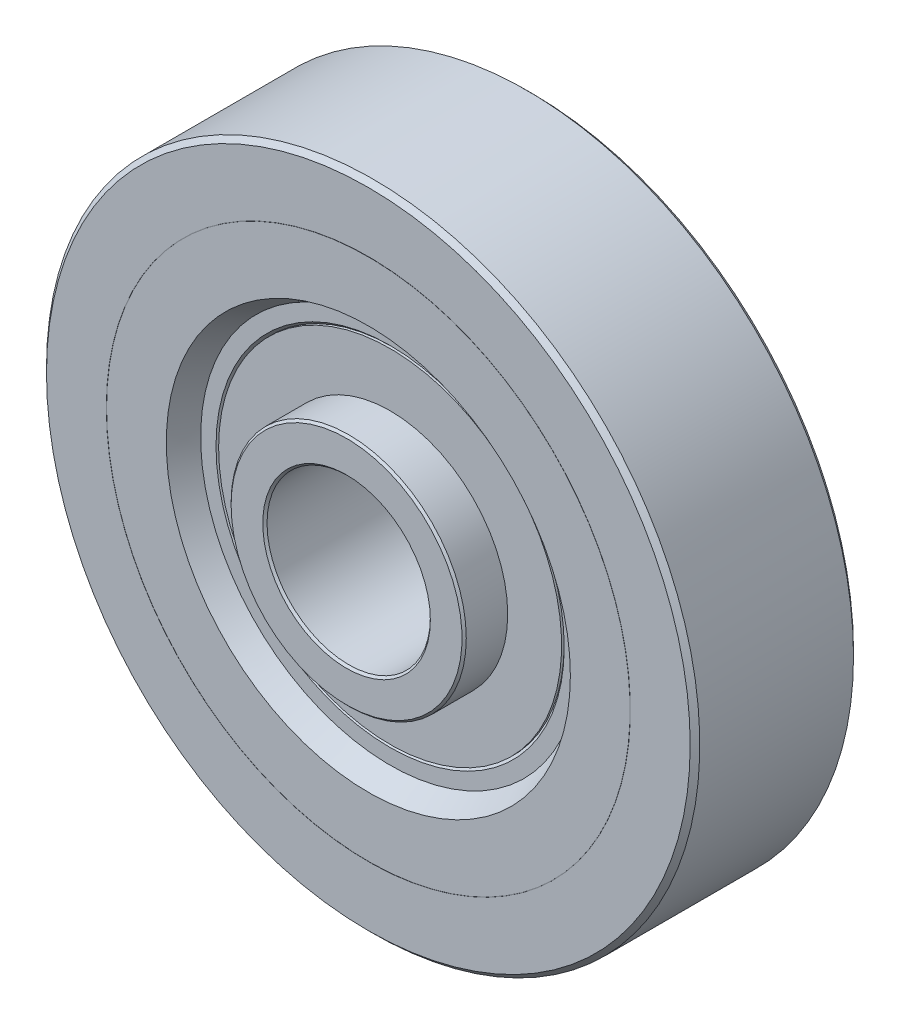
ISO-10303-21;
HEADER;
FILE_DESCRIPTION(('STEP AP214'),'2;1');
FILE_NAME('part.step','',(''),(''),'','','');
FILE_SCHEMA(('AUTOMOTIVE_DESIGN { 1 0 10303 214 1 1 1 1 }'));
ENDSEC;
DATA;
#1=APPLICATION_CONTEXT('core data for automotive mechanical design processes');
#2=APPLICATION_PROTOCOL_DEFINITION('international standard','automotive_design',2000,#1);
#3=PRODUCT_CONTEXT('',#1,'mechanical');
#4=PRODUCT('Part','Part','',(#3));
#5=PRODUCT_RELATED_PRODUCT_CATEGORY('part','',(#4));
#6=PRODUCT_DEFINITION_FORMATION('','',#4);
#7=PRODUCT_DEFINITION_CONTEXT('part definition',#1,'design');
#8=PRODUCT_DEFINITION('design','',#6,#7);
#9=PRODUCT_DEFINITION_SHAPE('','',#8);
#10=(LENGTH_UNIT() NAMED_UNIT(*) SI_UNIT(.MILLI.,.METRE.));
#11=(NAMED_UNIT(*) PLANE_ANGLE_UNIT() SI_UNIT($,.RADIAN.));
#12=(NAMED_UNIT(*) SI_UNIT($,.STERADIAN.) SOLID_ANGLE_UNIT());
#13=UNCERTAINTY_MEASURE_WITH_UNIT(LENGTH_MEASURE(1.E-05),#10,'distance_accuracy_value','');
#14=(GEOMETRIC_REPRESENTATION_CONTEXT(3) GLOBAL_UNCERTAINTY_ASSIGNED_CONTEXT((#13)) GLOBAL_UNIT_ASSIGNED_CONTEXT((#10,
#11,#12)) REPRESENTATION_CONTEXT('',''));
#15=CARTESIAN_POINT('',(0.,0.,0.));
#16=DIRECTION('',(0.,0.,1.));
#17=DIRECTION('',(1.,0.,0.));
#18=AXIS2_PLACEMENT_3D('',#15,#16,#17);
#19=CARTESIAN_POINT('',(0.,0.,4.8125));
#20=DIRECTION('',(0.,0.,-1.));
#21=DIRECTION('',(-1.,0.,0.));
#22=AXIS2_PLACEMENT_3D('',#19,#20,#21);
#23=CYLINDRICAL_SURFACE('',#22,15.75);
#24=CARTESIAN_POINT('',(0.,0.,5.5));
#25=DIRECTION('',(0.,0.,-1.));
#26=DIRECTION('',(-1.,0.,0.));
#27=AXIS2_PLACEMENT_3D('',#24,#25,#26);
#28=CIRCLE('',#27,15.75);
#29=CARTESIAN_POINT('',(-15.75,0.,5.5));
#30=VERTEX_POINT('',#29);
#31=EDGE_CURVE('E25',#30,#30,#28,.T.);
#32=ORIENTED_EDGE('',*,*,#31,.T.);
#33=EDGE_LOOP('',(#32));
#34=FACE_BOUND('',#33,.T.);
#35=CARTESIAN_POINT('',(0.,0.,5.26));
#36=DIRECTION('',(0.,0.,1.));
#37=DIRECTION('',(0.,1.,0.));
#38=AXIS2_PLACEMENT_3D('',#35,#36,#37);
#39=CIRCLE('',#38,15.75);
#40=CARTESIAN_POINT('',(0.,15.75,5.26));
#41=VERTEX_POINT('',#40);
#42=EDGE_CURVE('E8',#41,#41,#39,.T.);
#43=ORIENTED_EDGE('',*,*,#42,.T.);
#44=EDGE_LOOP('',(#43));
#45=FACE_BOUND('',#44,.T.);
#46=ADVANCED_FACE('F12',(#34,#45),#23,.T.);
#47=CARTESIAN_POINT('',(0.,13.275,5.5));
#48=DIRECTION('',(0.,0.,1.));
#49=DIRECTION('',(1.,0.,0.));
#50=AXIS2_PLACEMENT_3D('',#47,#48,#49);
#51=PLANE('',#50);
#52=ORIENTED_EDGE('',*,*,#31,.F.);
#53=EDGE_LOOP('',(#52));
#54=FACE_BOUND('',#53,.T.);
#55=CARTESIAN_POINT('',(0.,0.,5.5));
#56=DIRECTION('',(0.,0.,-1.));
#57=DIRECTION('',(-1.,0.,0.));
#58=AXIS2_PLACEMENT_3D('',#55,#56,#57);
#59=CIRCLE('',#58,10.8);
#60=CARTESIAN_POINT('',(-10.8,0.,5.5));
#61=VERTEX_POINT('',#60);
#62=EDGE_CURVE('E20',#61,#61,#59,.T.);
#63=ORIENTED_EDGE('',*,*,#62,.T.);
#64=EDGE_LOOP('',(#63));
#65=FACE_BOUND('',#64,.T.);
#66=ADVANCED_FACE('F105',(#54,#65),#51,.T.);
#67=CARTESIAN_POINT('',(0.,0.,-7.49));
#68=DIRECTION('',(0.,0.,-1.));
#69=DIRECTION('',(-1.,0.,0.));
#70=AXIS2_PLACEMENT_3D('',#67,#68,#69);
#71=CYLINDRICAL_SURFACE('',#70,24.044);
#72=CARTESIAN_POINT('',(0.,0.,-7.48));
#73=DIRECTION('',(0.,0.,-1.));
#74=DIRECTION('',(-1.,0.,0.));
#75=AXIS2_PLACEMENT_3D('',#72,#73,#74);
#76=CIRCLE('',#75,24.044);
#77=CARTESIAN_POINT('',(-24.044,0.,-7.48));
#78=VERTEX_POINT('',#77);
#79=EDGE_CURVE('E50',#78,#78,#76,.F.);
#80=ORIENTED_EDGE('',*,*,#79,.F.);
#81=EDGE_LOOP('',(#80));
#82=FACE_BOUND('',#81,.T.);
#83=CARTESIAN_POINT('',(0.,0.,-7.5));
#84=DIRECTION('',(0.,0.,-1.));
#85=DIRECTION('',(-1.,0.,0.));
#86=AXIS2_PLACEMENT_3D('',#83,#84,#85);
#87=CIRCLE('',#86,24.044);
#88=CARTESIAN_POINT('',(-24.044,0.,-7.5));
#89=VERTEX_POINT('',#88);
#90=EDGE_CURVE('E56',#89,#89,#87,.F.);
#91=ORIENTED_EDGE('',*,*,#90,.T.);
#92=EDGE_LOOP('',(#91));
#93=FACE_BOUND('',#92,.T.);
#94=ADVANCED_FACE('F112',(#82,#93),#71,.T.);
#95=CARTESIAN_POINT('',(0.,24.054,-7.48));
#96=DIRECTION('',(0.,1.77635683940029E-13,-1.));
#97=DIRECTION('',(0.,1.,1.77635683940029E-13));
#98=AXIS2_PLACEMENT_3D('',#95,#96,#97);
#99=PLANE('',#98);
#100=ORIENTED_EDGE('',*,*,#79,.T.);
#101=EDGE_LOOP('',(#100));
#102=FACE_BOUND('',#101,.T.);
#103=CARTESIAN_POINT('',(0.,0.,-7.48));
#104=DIRECTION('',(0.,0.,-1.));
#105=DIRECTION('',(-1.,0.,0.));
#106=AXIS2_PLACEMENT_3D('',#103,#104,#105);
#107=CIRCLE('',#106,24.064);
#108=CARTESIAN_POINT('',(-24.064,0.,-7.48));
#109=VERTEX_POINT('',#108);
#110=EDGE_CURVE('E44',#109,#109,#107,.T.);
#111=ORIENTED_EDGE('',*,*,#110,.T.);
#112=EDGE_LOOP('',(#111));
#113=FACE_BOUND('',#112,.T.);
#114=ADVANCED_FACE('F184',(#102,#113),#99,.T.);
#115=CARTESIAN_POINT('',(0.,0.,-7.49));
#116=DIRECTION('',(0.,0.,-1.));
#117=DIRECTION('',(-1.,0.,0.));
#118=AXIS2_PLACEMENT_3D('',#115,#116,#117);
#119=CYLINDRICAL_SURFACE('',#118,24.064);
#120=CARTESIAN_POINT('',(0.,0.,-7.5));
#121=DIRECTION('',(0.,0.,-1.));
#122=DIRECTION('',(-1.,0.,0.));
#123=AXIS2_PLACEMENT_3D('',#120,#121,#122);
#124=CIRCLE('',#123,24.064);
#125=CARTESIAN_POINT('',(-24.064,0.,-7.5));
#126=VERTEX_POINT('',#125);
#127=EDGE_CURVE('E38',#126,#126,#124,.F.);
#128=ORIENTED_EDGE('',*,*,#127,.F.);
#129=EDGE_LOOP('',(#128));
#130=FACE_BOUND('',#129,.T.);
#131=ORIENTED_EDGE('',*,*,#110,.F.);
#132=EDGE_LOOP('',(#131));
#133=FACE_BOUND('',#132,.T.);
#134=ADVANCED_FACE('F176',(#130,#133),#119,.F.);
#135=CARTESIAN_POINT('',(0.,26.8114117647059,-7.5));
#136=DIRECTION('',(0.,0.,-1.));
#137=DIRECTION('',(-1.,0.,0.));
#138=AXIS2_PLACEMENT_3D('',#135,#136,#137);
#139=PLANE('',#138);
#140=ORIENTED_EDGE('',*,*,#127,.T.);
#141=EDGE_LOOP('',(#140));
#142=FACE_BOUND('',#141,.T.);
#143=CARTESIAN_POINT('',(0.,0.,-7.5));
#144=DIRECTION('',(0.,0.,1.));
#145=DIRECTION('',(1.,0.,0.));
#146=AXIS2_PLACEMENT_3D('',#143,#144,#145);
#147=CIRCLE('',#146,29.5588235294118);
#148=CARTESIAN_POINT('',(29.5588235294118,0.,-7.5));
#149=VERTEX_POINT('',#148);
#150=EDGE_CURVE('E31',#149,#149,#147,.T.);
#151=ORIENTED_EDGE('',*,*,#150,.F.);
#152=EDGE_LOOP('',(#151));
#153=FACE_BOUND('',#152,.T.);
#154=ADVANCED_FACE('F168',(#142,#153),#139,.T.);
#155=CARTESIAN_POINT('',(0.,0.,-7.0588235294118));
#156=DIRECTION('',(0.,0.,1.));
#157=DIRECTION('',(1.,0.,0.));
#158=AXIS2_PLACEMENT_3D('',#155,#156,#157);
#159=CONICAL_SURFACE('',#158,30.,0.785398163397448);
#160=ORIENTED_EDGE('',*,*,#150,.T.);
#161=EDGE_LOOP('',(#160));
#162=FACE_BOUND('',#161,.T.);
#163=CARTESIAN_POINT('',(0.,0.,-7.0588235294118));
#164=DIRECTION('',(0.,0.,-1.));
#165=DIRECTION('',(-1.,0.,0.));
#166=AXIS2_PLACEMENT_3D('',#163,#164,#165);
#167=CIRCLE('',#166,30.);
#168=CARTESIAN_POINT('',(-30.,0.,-7.0588235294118));
#169=VERTEX_POINT('',#168);
#170=EDGE_CURVE('E29',#169,#169,#167,.F.);
#171=ORIENTED_EDGE('',*,*,#170,.F.);
#172=EDGE_LOOP('',(#171));
#173=FACE_BOUND('',#172,.T.);
#174=ADVANCED_FACE('F164',(#162,#173),#159,.T.);
#175=CARTESIAN_POINT('',(0.,0.,0.));
#176=DIRECTION('',(0.,0.,-1.));
#177=DIRECTION('',(-1.,0.,0.));
#178=AXIS2_PLACEMENT_3D('',#175,#176,#177);
#179=CYLINDRICAL_SURFACE('',#178,30.);
#180=CARTESIAN_POINT('',(0.,0.,7.05882352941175));
#181=DIRECTION('',(0.,0.,-1.));
#182=DIRECTION('',(-1.,0.,0.));
#183=AXIS2_PLACEMENT_3D('',#180,#181,#182);
#184=CIRCLE('',#183,30.);
#185=CARTESIAN_POINT('',(-30.,0.,7.05882352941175));
#186=VERTEX_POINT('',#185);
#187=EDGE_CURVE('E34',#186,#186,#184,.T.);
#188=ORIENTED_EDGE('',*,*,#187,.T.);
#189=EDGE_LOOP('',(#188));
#190=FACE_BOUND('',#189,.T.);
#191=ORIENTED_EDGE('',*,*,#170,.T.);
#192=EDGE_LOOP('',(#191));
#193=FACE_BOUND('',#192,.T.);
#194=ADVANCED_FACE('F157',(#190,#193),#179,.T.);
#195=CARTESIAN_POINT('',(0.,0.,7.05882352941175));
#196=DIRECTION('',(0.,0.,-1.));
#197=DIRECTION('',(-1.,0.,0.));
#198=AXIS2_PLACEMENT_3D('',#195,#196,#197);
#199=CONICAL_SURFACE('',#198,30.,0.785398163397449);
#200=CARTESIAN_POINT('',(0.,0.,7.5));
#201=DIRECTION('',(0.,0.,-1.));
#202=DIRECTION('',(-1.,0.,0.));
#203=AXIS2_PLACEMENT_3D('',#200,#201,#202);
#204=CIRCLE('',#203,29.5588235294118);
#205=CARTESIAN_POINT('',(-29.5588235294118,0.,7.5));
#206=VERTEX_POINT('',#205);
#207=EDGE_CURVE('E35',#206,#206,#204,.T.);
#208=ORIENTED_EDGE('',*,*,#207,.T.);
#209=EDGE_LOOP('',(#208));
#210=FACE_BOUND('',#209,.T.);
#211=ORIENTED_EDGE('',*,*,#187,.F.);
#212=EDGE_LOOP('',(#211));
#213=FACE_BOUND('',#212,.T.);
#214=ADVANCED_FACE('F163',(#210,#213),#199,.T.);
#215=CARTESIAN_POINT('',(0.,26.8114117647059,7.5));
#216=DIRECTION('',(0.,0.,1.));
#217=DIRECTION('',(1.,0.,0.));
#218=AXIS2_PLACEMENT_3D('',#215,#216,#217);
#219=PLANE('',#218);
#220=ORIENTED_EDGE('',*,*,#207,.F.);
#221=EDGE_LOOP('',(#220));
#222=FACE_BOUND('',#221,.T.);
#223=CARTESIAN_POINT('',(0.,0.,7.5));
#224=DIRECTION('',(0.,0.,-1.));
#225=DIRECTION('',(-1.,0.,0.));
#226=AXIS2_PLACEMENT_3D('',#223,#224,#225);
#227=CIRCLE('',#226,24.064);
#228=CARTESIAN_POINT('',(-24.064,0.,7.5));
#229=VERTEX_POINT('',#228);
#230=EDGE_CURVE('E41',#229,#229,#227,.T.);
#231=ORIENTED_EDGE('',*,*,#230,.T.);
#232=EDGE_LOOP('',(#231));
#233=FACE_BOUND('',#232,.T.);
#234=ADVANCED_FACE('F172',(#222,#233),#219,.T.);
#235=CARTESIAN_POINT('',(0.,0.,7.49));
#236=DIRECTION('',(0.,0.,-1.));
#237=DIRECTION('',(-1.,0.,0.));
#238=AXIS2_PLACEMENT_3D('',#235,#236,#237);
#239=CYLINDRICAL_SURFACE('',#238,24.064);
#240=CARTESIAN_POINT('',(0.,0.,7.48));
#241=DIRECTION('',(0.,0.,-1.));
#242=DIRECTION('',(-1.,0.,0.));
#243=AXIS2_PLACEMENT_3D('',#240,#241,#242);
#244=CIRCLE('',#243,24.064);
#245=CARTESIAN_POINT('',(-24.064,0.,7.48));
#246=VERTEX_POINT('',#245);
#247=EDGE_CURVE('E47',#246,#246,#244,.F.);
#248=ORIENTED_EDGE('',*,*,#247,.F.);
#249=EDGE_LOOP('',(#248));
#250=FACE_BOUND('',#249,.T.);
#251=ORIENTED_EDGE('',*,*,#230,.F.);
#252=EDGE_LOOP('',(#251));
#253=FACE_BOUND('',#252,.T.);
#254=ADVANCED_FACE('F180',(#250,#253),#239,.F.);
#255=CARTESIAN_POINT('',(0.,24.054,7.48));
#256=DIRECTION('',(0.,0.,1.));
#257=DIRECTION('',(1.,0.,0.));
#258=AXIS2_PLACEMENT_3D('',#255,#256,#257);
#259=PLANE('',#258);
#260=ORIENTED_EDGE('',*,*,#247,.T.);
#261=EDGE_LOOP('',(#260));
#262=FACE_BOUND('',#261,.T.);
#263=CARTESIAN_POINT('',(0.,0.,7.48));
#264=DIRECTION('',(0.,0.,-1.));
#265=DIRECTION('',(-1.,0.,0.));
#266=AXIS2_PLACEMENT_3D('',#263,#264,#265);
#267=CIRCLE('',#266,24.044);
#268=CARTESIAN_POINT('',(-24.044,0.,7.48));
#269=VERTEX_POINT('',#268);
#270=EDGE_CURVE('E53',#269,#269,#267,.T.);
#271=ORIENTED_EDGE('',*,*,#270,.T.);
#272=EDGE_LOOP('',(#271));
#273=FACE_BOUND('',#272,.T.);
#274=ADVANCED_FACE('F188',(#262,#273),#259,.T.);
#275=CARTESIAN_POINT('',(0.,0.,7.49));
#276=DIRECTION('',(0.,0.,-1.));
#277=DIRECTION('',(-1.,0.,0.));
#278=AXIS2_PLACEMENT_3D('',#275,#276,#277);
#279=CYLINDRICAL_SURFACE('',#278,24.044);
#280=CARTESIAN_POINT('',(0.,0.,7.5));
#281=DIRECTION('',(0.,0.,-1.));
#282=DIRECTION('',(-1.,0.,0.));
#283=AXIS2_PLACEMENT_3D('',#280,#281,#282);
#284=CIRCLE('',#283,24.044);
#285=CARTESIAN_POINT('',(-24.044,0.,7.5));
#286=VERTEX_POINT('',#285);
#287=EDGE_CURVE('E59',#286,#286,#284,.T.);
#288=ORIENTED_EDGE('',*,*,#287,.T.);
#289=EDGE_LOOP('',(#288));
#290=FACE_BOUND('',#289,.T.);
#291=ORIENTED_EDGE('',*,*,#270,.F.);
#292=EDGE_LOOP('',(#291));
#293=FACE_BOUND('',#292,.T.);
#294=ADVANCED_FACE('F96',(#290,#293),#279,.T.);
#295=CARTESIAN_POINT('',(0.,21.2993502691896,7.5));
#296=DIRECTION('',(0.,0.,1.));
#297=DIRECTION('',(1.,0.,0.));
#298=AXIS2_PLACEMENT_3D('',#295,#296,#297);
#299=PLANE('',#298);
#300=ORIENTED_EDGE('',*,*,#287,.F.);
#301=EDGE_LOOP('',(#300));
#302=FACE_BOUND('',#301,.T.);
#303=CARTESIAN_POINT('',(0.,0.,7.5));
#304=DIRECTION('',(0.,0.,1.));
#305=DIRECTION('',(1.,0.,0.));
#306=AXIS2_PLACEMENT_3D('',#303,#304,#305);
#307=CIRCLE('',#306,18.5547005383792);
#308=CARTESIAN_POINT('',(18.5547005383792,0.,7.5));
#309=VERTEX_POINT('',#308);
#310=EDGE_CURVE('E65',#309,#309,#307,.F.);
#311=ORIENTED_EDGE('',*,*,#310,.T.);
#312=EDGE_LOOP('',(#311));
#313=FACE_BOUND('',#312,.T.);
#314=ADVANCED_FACE('F95',(#302,#313),#299,.T.);
#315=CARTESIAN_POINT('',(0.,0.,7.5));
#316=DIRECTION('',(0.,0.,1.));
#317=DIRECTION('',(1.,0.,0.));
#318=AXIS2_PLACEMENT_3D('',#315,#316,#317);
#319=CONICAL_SURFACE('',#318,18.5547005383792,0.523598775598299);
#320=CARTESIAN_POINT('',(0.,0.,5.5));
#321=DIRECTION('',(0.,0.,1.));
#322=DIRECTION('',(1.,0.,0.));
#323=AXIS2_PLACEMENT_3D('',#320,#321,#322);
#324=CIRCLE('',#323,17.4);
#325=CARTESIAN_POINT('',(17.4,0.,5.5));
#326=VERTEX_POINT('',#325);
#327=EDGE_CURVE('E71',#326,#326,#324,.T.);
#328=ORIENTED_EDGE('',*,*,#327,.F.);
#329=EDGE_LOOP('',(#328));
#330=FACE_BOUND('',#329,.T.);
#331=ORIENTED_EDGE('',*,*,#310,.F.);
#332=EDGE_LOOP('',(#331));
#333=FACE_BOUND('',#332,.T.);
#334=ADVANCED_FACE('F97',(#330,#333),#319,.F.);
#335=CARTESIAN_POINT('',(0.,16.695,5.5));
#336=DIRECTION('',(0.,0.,1.));
#337=DIRECTION('',(1.,0.,0.));
#338=AXIS2_PLACEMENT_3D('',#335,#336,#337);
#339=PLANE('',#338);
#340=ORIENTED_EDGE('',*,*,#327,.T.);
#341=EDGE_LOOP('',(#340));
#342=FACE_BOUND('',#341,.T.);
#343=CARTESIAN_POINT('',(0.,0.,5.5));
#344=DIRECTION('',(0.,0.,1.));
#345=DIRECTION('',(1.,0.,0.));
#346=AXIS2_PLACEMENT_3D('',#343,#344,#345);
#347=CIRCLE('',#346,15.99);
#348=CARTESIAN_POINT('',(15.99,0.,5.5));
#349=VERTEX_POINT('',#348);
#350=EDGE_CURVE('E16',#349,#349,#347,.F.);
#351=ORIENTED_EDGE('',*,*,#350,.T.);
#352=EDGE_LOOP('',(#351));
#353=FACE_BOUND('',#352,.T.);
#354=ADVANCED_FACE('F80',(#342,#353),#339,.T.);
#355=CARTESIAN_POINT('',(0.,0.,5.5));
#356=DIRECTION('',(0.,0.,1.));
#357=DIRECTION('',(1.,0.,0.));
#358=AXIS2_PLACEMENT_3D('',#355,#356,#357);
#359=CONICAL_SURFACE('',#358,15.99,0.785398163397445);
#360=ORIENTED_EDGE('',*,*,#42,.F.);
#361=EDGE_LOOP('',(#360));
#362=FACE_BOUND('',#361,.T.);
#363=ORIENTED_EDGE('',*,*,#350,.F.);
#364=EDGE_LOOP('',(#363));
#365=FACE_BOUND('',#364,.T.);
#366=ADVANCED_FACE('F14',(#362,#365),#359,.F.);
#367=CARTESIAN_POINT('',(0.,21.2993502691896,-7.5));
#368=DIRECTION('',(0.,0.,-1.));
#369=DIRECTION('',(-1.,0.,0.));
#370=AXIS2_PLACEMENT_3D('',#367,#368,#369);
#371=PLANE('',#370);
#372=CARTESIAN_POINT('',(0.,0.,-7.5));
#373=DIRECTION('',(0.,0.,-1.));
#374=DIRECTION('',(-1.,0.,0.));
#375=AXIS2_PLACEMENT_3D('',#372,#373,#374);
#376=CIRCLE('',#375,18.5547005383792);
#377=CARTESIAN_POINT('',(-18.5547005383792,0.,-7.5));
#378=VERTEX_POINT('',#377);
#379=EDGE_CURVE('E62',#378,#378,#376,.F.);
#380=ORIENTED_EDGE('',*,*,#379,.T.);
#381=EDGE_LOOP('',(#380));
#382=FACE_BOUND('',#381,.T.);
#383=ORIENTED_EDGE('',*,*,#90,.F.);
#384=EDGE_LOOP('',(#383));
#385=FACE_BOUND('',#384,.T.);
#386=ADVANCED_FACE('F83',(#382,#385),#371,.T.);
#387=CARTESIAN_POINT('',(0.,0.,-7.5));
#388=DIRECTION('',(0.,0.,-1.));
#389=DIRECTION('',(-1.,0.,0.));
#390=AXIS2_PLACEMENT_3D('',#387,#388,#389);
#391=CONICAL_SURFACE('',#390,18.5547005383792,0.523598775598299);
#392=ORIENTED_EDGE('',*,*,#379,.F.);
#393=EDGE_LOOP('',(#392));
#394=FACE_BOUND('',#393,.T.);
#395=CARTESIAN_POINT('',(0.,0.,-5.5));
#396=DIRECTION('',(0.,0.,-1.));
#397=DIRECTION('',(-1.,0.,0.));
#398=AXIS2_PLACEMENT_3D('',#395,#396,#397);
#399=CIRCLE('',#398,17.4);
#400=CARTESIAN_POINT('',(-17.4,0.,-5.5));
#401=VERTEX_POINT('',#400);
#402=EDGE_CURVE('E68',#401,#401,#399,.T.);
#403=ORIENTED_EDGE('',*,*,#402,.F.);
#404=EDGE_LOOP('',(#403));
#405=FACE_BOUND('',#404,.T.);
#406=ADVANCED_FACE('F92',(#394,#405),#391,.F.);
#407=CARTESIAN_POINT('',(0.,16.695,-5.5));
#408=DIRECTION('',(0.,0.,-1.));
#409=DIRECTION('',(-1.,0.,0.));
#410=AXIS2_PLACEMENT_3D('',#407,#408,#409);
#411=PLANE('',#410);
#412=CARTESIAN_POINT('',(0.,0.,-5.5));
#413=DIRECTION('',(0.,0.,-1.));
#414=DIRECTION('',(-1.,0.,0.));
#415=AXIS2_PLACEMENT_3D('',#412,#413,#414);
#416=CIRCLE('',#415,15.99);
#417=CARTESIAN_POINT('',(-15.99,0.,-5.5));
#418=VERTEX_POINT('',#417);
#419=EDGE_CURVE('E73',#418,#418,#416,.F.);
#420=ORIENTED_EDGE('',*,*,#419,.T.);
#421=EDGE_LOOP('',(#420));
#422=FACE_BOUND('',#421,.T.);
#423=ORIENTED_EDGE('',*,*,#402,.T.);
#424=EDGE_LOOP('',(#423));
#425=FACE_BOUND('',#424,.T.);
#426=ADVANCED_FACE('F100',(#422,#425),#411,.T.);
#427=CARTESIAN_POINT('',(0.,0.,-5.5));
#428=DIRECTION('',(0.,0.,-1.));
#429=DIRECTION('',(-1.,0.,0.));
#430=AXIS2_PLACEMENT_3D('',#427,#428,#429);
#431=CONICAL_SURFACE('',#430,15.99,0.785398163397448);
#432=ORIENTED_EDGE('',*,*,#419,.F.);
#433=EDGE_LOOP('',(#432));
#434=FACE_BOUND('',#433,.T.);
#435=CARTESIAN_POINT('',(0.,0.,-5.26));
#436=DIRECTION('',(0.,0.,-1.));
#437=DIRECTION('',(-1.,0.,0.));
#438=AXIS2_PLACEMENT_3D('',#435,#436,#437);
#439=CIRCLE('',#438,15.75);
#440=CARTESIAN_POINT('',(-15.75,0.,-5.26));
#441=VERTEX_POINT('',#440);
#442=EDGE_CURVE('E463',#441,#441,#439,.T.);
#443=ORIENTED_EDGE('',*,*,#442,.F.);
#444=EDGE_LOOP('',(#443));
#445=FACE_BOUND('',#444,.T.);
#446=ADVANCED_FACE('F85',(#434,#445),#431,.F.);
#447=CARTESIAN_POINT('',(0.,0.,-4.8125));
#448=DIRECTION('',(0.,0.,-1.));
#449=DIRECTION('',(-1.,0.,0.));
#450=AXIS2_PLACEMENT_3D('',#447,#448,#449);
#451=CYLINDRICAL_SURFACE('',#450,15.75);
#452=ORIENTED_EDGE('',*,*,#442,.T.);
#453=EDGE_LOOP('',(#452));
#454=FACE_BOUND('',#453,.T.);
#455=CARTESIAN_POINT('',(0.,0.,-5.5));
#456=DIRECTION('',(0.,0.,-1.));
#457=DIRECTION('',(-1.,0.,0.));
#458=AXIS2_PLACEMENT_3D('',#455,#456,#457);
#459=CIRCLE('',#458,15.75);
#460=CARTESIAN_POINT('',(-15.75,0.,-5.5));
#461=VERTEX_POINT('',#460);
#462=EDGE_CURVE('E460',#461,#461,#459,.T.);
#463=ORIENTED_EDGE('',*,*,#462,.F.);
#464=EDGE_LOOP('',(#463));
#465=FACE_BOUND('',#464,.T.);
#466=ADVANCED_FACE('F102',(#454,#465),#451,.T.);
#467=CARTESIAN_POINT('',(0.,13.275,-5.5));
#468=DIRECTION('',(0.,0.,-1.));
#469=DIRECTION('',(-1.,0.,0.));
#470=AXIS2_PLACEMENT_3D('',#467,#468,#469);
#471=PLANE('',#470);
#472=CARTESIAN_POINT('',(0.,0.,-5.5));
#473=DIRECTION('',(0.,0.,-1.));
#474=DIRECTION('',(-1.,0.,0.));
#475=AXIS2_PLACEMENT_3D('',#472,#473,#474);
#476=CIRCLE('',#475,10.8);
#477=CARTESIAN_POINT('',(-10.8,0.,-5.5));
#478=VERTEX_POINT('',#477);
#479=EDGE_CURVE('E466',#478,#478,#476,.F.);
#480=ORIENTED_EDGE('',*,*,#479,.T.);
#481=EDGE_LOOP('',(#480));
#482=FACE_BOUND('',#481,.T.);
#483=ORIENTED_EDGE('',*,*,#462,.T.);
#484=EDGE_LOOP('',(#483));
#485=FACE_BOUND('',#484,.T.);
#486=ADVANCED_FACE('F118',(#482,#485),#471,.T.);
#487=CARTESIAN_POINT('',(0.,0.,-5.251166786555));
#488=DIRECTION('',(0.,0.,-1.));
#489=DIRECTION('',(-1.,0.,0.));
#490=AXIS2_PLACEMENT_3D('',#487,#488,#489);
#491=CYLINDRICAL_SURFACE('',#490,10.8);
#492=ORIENTED_EDGE('',*,*,#479,.F.);
#493=EDGE_LOOP('',(#492));
#494=FACE_BOUND('',#493,.T.);
#495=CARTESIAN_POINT('',(0.,0.,-9.3036363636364));
#496=DIRECTION('',(0.,0.,1.));
#497=DIRECTION('',(0.,1.,0.));
#498=AXIS2_PLACEMENT_3D('',#495,#496,#497);
#499=CIRCLE('',#498,10.8);
#500=CARTESIAN_POINT('',(0.,10.8,-9.3036363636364));
#501=VERTEX_POINT('',#500);
#502=EDGE_CURVE('E437',#501,#501,#499,.F.);
#503=ORIENTED_EDGE('',*,*,#502,.F.);
#504=EDGE_LOOP('',(#503));
#505=FACE_BOUND('',#504,.T.);
#506=ADVANCED_FACE('F121',(#494,#505),#491,.T.);
#507=CARTESIAN_POINT('',(0.,0.,-9.3036363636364));
#508=DIRECTION('',(0.,0.,1.));
#509=DIRECTION('',(1.,0.,0.));
#510=AXIS2_PLACEMENT_3D('',#507,#508,#509);
#511=CONICAL_SURFACE('',#510,10.8,0.785398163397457);
#512=ORIENTED_EDGE('',*,*,#502,.T.);
#513=EDGE_LOOP('',(#512));
#514=FACE_BOUND('',#513,.T.);
#515=CARTESIAN_POINT('',(0.,0.,-9.5));
#516=DIRECTION('',(0.,0.,1.));
#517=DIRECTION('',(1.,0.,0.));
#518=AXIS2_PLACEMENT_3D('',#515,#516,#517);
#519=CIRCLE('',#518,10.6036363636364);
#520=CARTESIAN_POINT('',(10.6036363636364,0.,-9.5));
#521=VERTEX_POINT('',#520);
#522=EDGE_CURVE('E445',#521,#521,#519,.F.);
#523=ORIENTED_EDGE('',*,*,#522,.F.);
#524=EDGE_LOOP('',(#523));
#525=FACE_BOUND('',#524,.T.);
#526=ADVANCED_FACE('F142',(#514,#525),#511,.T.);
#527=CARTESIAN_POINT('',(0.,9.15,-9.5));
#528=DIRECTION('',(0.,0.,-1.));
#529=DIRECTION('',(-1.,0.,0.));
#530=AXIS2_PLACEMENT_3D('',#527,#528,#529);
#531=PLANE('',#530);
#532=CARTESIAN_POINT('',(0.,0.,-9.5));
#533=DIRECTION('',(0.,0.,-1.));
#534=DIRECTION('',(-1.,0.,0.));
#535=AXIS2_PLACEMENT_3D('',#532,#533,#534);
#536=CIRCLE('',#535,7.69636363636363);
#537=CARTESIAN_POINT('',(-7.69636363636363,0.,-9.5));
#538=VERTEX_POINT('',#537);
#539=EDGE_CURVE('E451',#538,#538,#536,.F.);
#540=ORIENTED_EDGE('',*,*,#539,.T.);
#541=EDGE_LOOP('',(#540));
#542=FACE_BOUND('',#541,.T.);
#543=ORIENTED_EDGE('',*,*,#522,.T.);
#544=EDGE_LOOP('',(#543));
#545=FACE_BOUND('',#544,.T.);
#546=ADVANCED_FACE('F134',(#542,#545),#531,.T.);
#547=CARTESIAN_POINT('',(0.,0.,-9.5));
#548=DIRECTION('',(0.,0.,-1.));
#549=DIRECTION('',(-1.,0.,0.));
#550=AXIS2_PLACEMENT_3D('',#547,#548,#549);
#551=CONICAL_SURFACE('',#550,7.69636363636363,0.78539816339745);
#552=ORIENTED_EDGE('',*,*,#539,.F.);
#553=EDGE_LOOP('',(#552));
#554=FACE_BOUND('',#553,.T.);
#555=CARTESIAN_POINT('',(0.,0.,-9.3036363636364));
#556=DIRECTION('',(0.,0.,-1.));
#557=DIRECTION('',(-1.,0.,0.));
#558=AXIS2_PLACEMENT_3D('',#555,#556,#557);
#559=CIRCLE('',#558,7.5);
#560=CARTESIAN_POINT('',(-7.5,0.,-9.3036363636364));
#561=VERTEX_POINT('',#560);
#562=EDGE_CURVE('E457',#561,#561,#559,.F.);
#563=ORIENTED_EDGE('',*,*,#562,.T.);
#564=EDGE_LOOP('',(#563));
#565=FACE_BOUND('',#564,.T.);
#566=ADVANCED_FACE('F130',(#554,#565),#551,.F.);
#567=CARTESIAN_POINT('',(0.,0.,0.));
#568=DIRECTION('',(0.,0.,-1.));
#569=DIRECTION('',(-1.,0.,0.));
#570=AXIS2_PLACEMENT_3D('',#567,#568,#569);
#571=CYLINDRICAL_SURFACE('',#570,7.5);
#572=ORIENTED_EDGE('',*,*,#562,.F.);
#573=EDGE_LOOP('',(#572));
#574=FACE_BOUND('',#573,.T.);
#575=CARTESIAN_POINT('',(0.,0.,9.30363636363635));
#576=DIRECTION('',(0.,0.,-1.));
#577=DIRECTION('',(-1.,0.,0.));
#578=AXIS2_PLACEMENT_3D('',#575,#576,#577);
#579=CIRCLE('',#578,7.5);
#580=CARTESIAN_POINT('',(-7.5,0.,9.30363636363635));
#581=VERTEX_POINT('',#580);
#582=EDGE_CURVE('E453',#581,#581,#579,.T.);
#583=ORIENTED_EDGE('',*,*,#582,.F.);
#584=EDGE_LOOP('',(#583));
#585=FACE_BOUND('',#584,.T.);
#586=ADVANCED_FACE('F123',(#574,#585),#571,.F.);
#587=CARTESIAN_POINT('',(0.,0.,9.5));
#588=DIRECTION('',(0.,0.,1.));
#589=DIRECTION('',(1.,0.,0.));
#590=AXIS2_PLACEMENT_3D('',#587,#588,#589);
#591=CONICAL_SURFACE('',#590,7.69636363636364,0.785398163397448);
#592=ORIENTED_EDGE('',*,*,#582,.T.);
#593=EDGE_LOOP('',(#592));
#594=FACE_BOUND('',#593,.T.);
#595=CARTESIAN_POINT('',(0.,0.,9.5));
#596=DIRECTION('',(0.,0.,1.));
#597=DIRECTION('',(1.,0.,0.));
#598=AXIS2_PLACEMENT_3D('',#595,#596,#597);
#599=CIRCLE('',#598,7.69636363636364);
#600=CARTESIAN_POINT('',(7.69636363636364,0.,9.5));
#601=VERTEX_POINT('',#600);
#602=EDGE_CURVE('E448',#601,#601,#599,.F.);
#603=ORIENTED_EDGE('',*,*,#602,.F.);
#604=EDGE_LOOP('',(#603));
#605=FACE_BOUND('',#604,.T.);
#606=ADVANCED_FACE('F129',(#594,#605),#591,.F.);
#607=CARTESIAN_POINT('',(0.,9.15,9.5));
#608=DIRECTION('',(0.,0.,1.));
#609=DIRECTION('',(1.,0.,0.));
#610=AXIS2_PLACEMENT_3D('',#607,#608,#609);
#611=PLANE('',#610);
#612=CARTESIAN_POINT('',(0.,0.,9.5));
#613=DIRECTION('',(0.,0.,-1.));
#614=DIRECTION('',(-1.,0.,0.));
#615=AXIS2_PLACEMENT_3D('',#612,#613,#614);
#616=CIRCLE('',#615,10.6036363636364);
#617=CARTESIAN_POINT('',(-10.6036363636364,0.,9.5));
#618=VERTEX_POINT('',#617);
#619=EDGE_CURVE('E442',#618,#618,#616,.F.);
#620=ORIENTED_EDGE('',*,*,#619,.T.);
#621=EDGE_LOOP('',(#620));
#622=FACE_BOUND('',#621,.T.);
#623=ORIENTED_EDGE('',*,*,#602,.T.);
#624=EDGE_LOOP('',(#623));
#625=FACE_BOUND('',#624,.T.);
#626=ADVANCED_FACE('F138',(#622,#625),#611,.T.);
#627=CARTESIAN_POINT('',(0.,0.,9.30363636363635));
#628=DIRECTION('',(0.,0.,-1.));
#629=DIRECTION('',(-1.,0.,0.));
#630=AXIS2_PLACEMENT_3D('',#627,#628,#629);
#631=CONICAL_SURFACE('',#630,10.8,0.785398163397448);
#632=ORIENTED_EDGE('',*,*,#619,.F.);
#633=EDGE_LOOP('',(#632));
#634=FACE_BOUND('',#633,.T.);
#635=CARTESIAN_POINT('',(0.,0.,9.30363636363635));
#636=DIRECTION('',(0.,0.,-1.));
#637=DIRECTION('',(0.,1.,0.));
#638=AXIS2_PLACEMENT_3D('',#635,#636,#637);
#639=CIRCLE('',#638,10.8);
#640=CARTESIAN_POINT('',(0.,10.8,9.30363636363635));
#641=VERTEX_POINT('',#640);
#642=EDGE_CURVE('E435',#641,#641,#639,.F.);
#643=ORIENTED_EDGE('',*,*,#642,.T.);
#644=EDGE_LOOP('',(#643));
#645=FACE_BOUND('',#644,.T.);
#646=ADVANCED_FACE('F146',(#634,#645),#631,.T.);
#647=CARTESIAN_POINT('',(0.,0.,5.25116678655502));
#648=DIRECTION('',(0.,0.,-1.));
#649=DIRECTION('',(-1.,0.,0.));
#650=AXIS2_PLACEMENT_3D('',#647,#648,#649);
#651=CYLINDRICAL_SURFACE('',#650,10.8);
#652=ORIENTED_EDGE('',*,*,#642,.F.);
#653=EDGE_LOOP('',(#652));
#654=FACE_BOUND('',#653,.T.);
#655=ORIENTED_EDGE('',*,*,#62,.F.);
#656=EDGE_LOOP('',(#655));
#657=FACE_BOUND('',#656,.T.);
#658=ADVANCED_FACE('F115',(#654,#657),#651,.T.);
#659=CLOSED_SHELL('',(#46,#66,#94,#114,#134,#154,#174,#194,#214,#234,#254,#274,#294,#314,#334,
#354,#366,#386,#406,#426,#446,#466,#486,#506,#526,#546,#566,#586,#606,#626,#646,#658));
#660=MANIFOLD_SOLID_BREP('B1',#659);
#661=ADVANCED_BREP_SHAPE_REPRESENTATION('',(#18,#660),#14);
#662=SHAPE_DEFINITION_REPRESENTATION(#9,#661);
ENDSEC;
END-ISO-10303-21;
